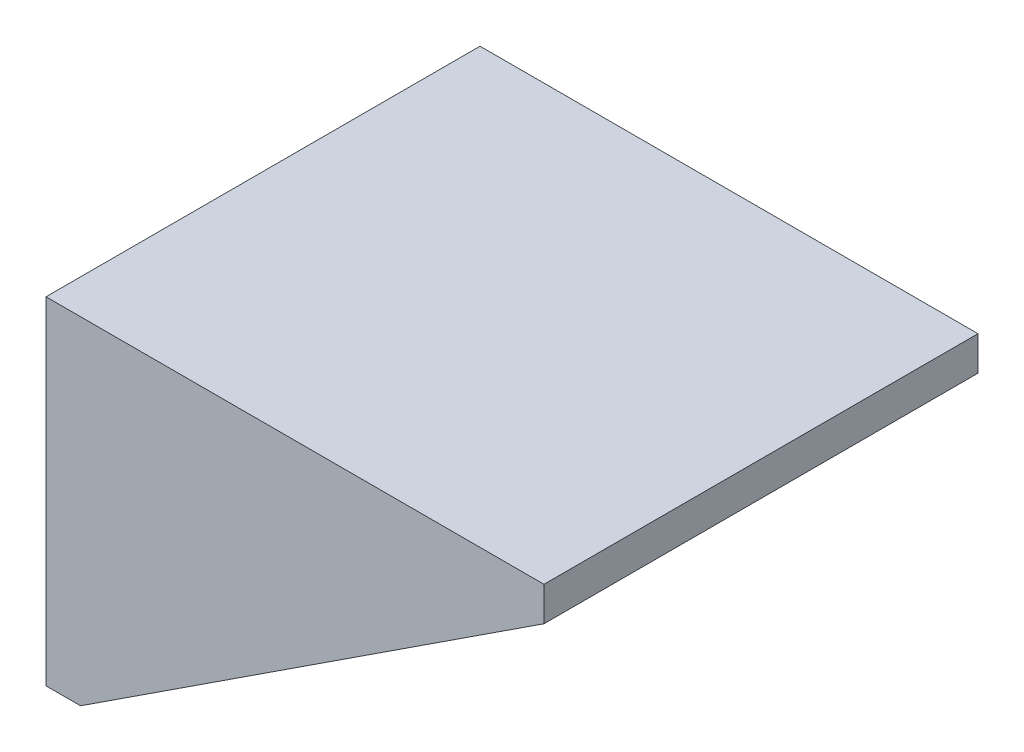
ISO-10303-21;
HEADER;
FILE_DESCRIPTION(('STEP AP214'),'2;1');
FILE_NAME('part.step','',(''),(''),'','','');
FILE_SCHEMA(('AUTOMOTIVE_DESIGN { 1 0 10303 214 1 1 1 1 }'));
ENDSEC;
DATA;
#1=APPLICATION_CONTEXT('core data for automotive mechanical design processes');
#2=APPLICATION_PROTOCOL_DEFINITION('international standard','automotive_design',2000,#1);
#3=PRODUCT_CONTEXT('',#1,'mechanical');
#4=PRODUCT('Part','Part','',(#3));
#5=PRODUCT_RELATED_PRODUCT_CATEGORY('part','',(#4));
#6=PRODUCT_DEFINITION_FORMATION('','',#4);
#7=PRODUCT_DEFINITION_CONTEXT('part definition',#1,'design');
#8=PRODUCT_DEFINITION('design','',#6,#7);
#9=PRODUCT_DEFINITION_SHAPE('','',#8);
#10=(LENGTH_UNIT() NAMED_UNIT(*) SI_UNIT(.MILLI.,.METRE.));
#11=(NAMED_UNIT(*) PLANE_ANGLE_UNIT() SI_UNIT($,.RADIAN.));
#12=(NAMED_UNIT(*) SI_UNIT($,.STERADIAN.) SOLID_ANGLE_UNIT());
#13=UNCERTAINTY_MEASURE_WITH_UNIT(LENGTH_MEASURE(1.E-05),#10,'distance_accuracy_value','');
#14=(GEOMETRIC_REPRESENTATION_CONTEXT(3) GLOBAL_UNCERTAINTY_ASSIGNED_CONTEXT((#13)) GLOBAL_UNIT_ASSIGNED_CONTEXT((#10,
#11,#12)) REPRESENTATION_CONTEXT('',''));
#15=CARTESIAN_POINT('',(0.,0.,0.));
#16=DIRECTION('',(0.,0.,1.));
#17=DIRECTION('',(1.,0.,0.));
#18=AXIS2_PLACEMENT_3D('',#15,#16,#17);
#19=CARTESIAN_POINT('',(0.,93.0742106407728,25.4));
#20=DIRECTION('',(1.,0.,0.));
#21=DIRECTION('',(0.,0.,-1.));
#22=AXIS2_PLACEMENT_3D('',#19,#20,#21);
#23=PLANE('',#22);
#24=DIRECTION('',(0.,-1.,0.));
#25=VECTOR('',#24,1.);
#26=CARTESIAN_POINT('',(0.,93.0742106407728,0.));
#27=LINE('',#26,#25);
#28=CARTESIAN_POINT('',(0.,112.794509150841,0.));
#29=VERTEX_POINT('',#28);
#30=CARTESIAN_POINT('',(0.,93.0742106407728,0.));
#31=VERTEX_POINT('',#30);
#32=EDGE_CURVE('E107',#29,#31,#27,.T.);
#33=ORIENTED_EDGE('',*,*,#32,.T.);
#34=DIRECTION('',(0.,0.,-1.));
#35=VECTOR('',#34,1.);
#36=CARTESIAN_POINT('',(0.,93.0742106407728,25.4));
#37=LINE('',#36,#35);
#38=CARTESIAN_POINT('',(0.,93.0742106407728,25.4));
#39=VERTEX_POINT('',#38);
#40=EDGE_CURVE('E11',#39,#31,#37,.T.);
#41=ORIENTED_EDGE('',*,*,#40,.F.);
#42=DIRECTION('',(0.,-1.,0.));
#43=VECTOR('',#42,1.);
#44=CARTESIAN_POINT('',(0.,93.0742106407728,25.4));
#45=LINE('',#44,#43);
#46=CARTESIAN_POINT('',(0.,112.794509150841,25.4));
#47=VERTEX_POINT('',#46);
#48=EDGE_CURVE('E115',#47,#39,#45,.T.);
#49=ORIENTED_EDGE('',*,*,#48,.F.);
#50=DIRECTION('',(0.,0.,-1.));
#51=VECTOR('',#50,1.);
#52=CARTESIAN_POINT('',(0.,112.794509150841,25.4));
#53=LINE('',#52,#51);
#54=EDGE_CURVE('E103',#47,#29,#53,.T.);
#55=ORIENTED_EDGE('',*,*,#54,.T.);
#56=EDGE_LOOP('',(#33,#41,#49,#55));
#57=FACE_BOUND('',#56,.T.);
#58=ADVANCED_FACE('F33',(#57),#23,.F.);
#59=CARTESIAN_POINT('',(0.,93.0742106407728,25.4));
#60=DIRECTION('',(0.,1.,0.));
#61=DIRECTION('',(0.,0.,1.));
#62=AXIS2_PLACEMENT_3D('',#59,#60,#61);
#63=PLANE('',#62);
#64=DIRECTION('',(1.,0.,0.));
#65=VECTOR('',#64,1.);
#66=CARTESIAN_POINT('',(0.,93.0742106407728,0.));
#67=LINE('',#66,#65);
#68=CARTESIAN_POINT('',(2.02050691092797,93.0742106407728,0.));
#69=VERTEX_POINT('',#68);
#70=EDGE_CURVE('E110',#31,#69,#67,.T.);
#71=ORIENTED_EDGE('',*,*,#70,.T.);
#72=DIRECTION('',(0.,0.,-1.));
#73=VECTOR('',#72,1.);
#74=CARTESIAN_POINT('',(2.02050691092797,93.0742106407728,25.4));
#75=LINE('',#74,#73);
#76=CARTESIAN_POINT('',(2.02050691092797,93.0742106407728,25.4));
#77=VERTEX_POINT('',#76);
#78=EDGE_CURVE('E41',#77,#69,#75,.T.);
#79=ORIENTED_EDGE('',*,*,#78,.F.);
#80=DIRECTION('',(1.,0.,0.));
#81=VECTOR('',#80,1.);
#82=CARTESIAN_POINT('',(0.,93.0742106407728,25.4));
#83=LINE('',#82,#81);
#84=EDGE_CURVE('E83',#39,#77,#83,.T.);
#85=ORIENTED_EDGE('',*,*,#84,.F.);
#86=ORIENTED_EDGE('',*,*,#40,.T.);
#87=EDGE_LOOP('',(#71,#79,#85,#86));
#88=FACE_BOUND('',#87,.T.);
#89=ADVANCED_FACE('F134',(#88),#63,.F.);
#90=CARTESIAN_POINT('',(29.1422918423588,110.792229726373,25.4));
#91=DIRECTION('',(-0.546915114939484,0.837188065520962,0.));
#92=DIRECTION('',(-0.837188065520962,-0.546915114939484,0.));
#93=AXIS2_PLACEMENT_3D('',#90,#91,#92);
#94=PLANE('',#93);
#95=DIRECTION('',(0.837188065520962,0.546915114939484,0.));
#96=VECTOR('',#95,1.);
#97=CARTESIAN_POINT('',(29.1422918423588,110.792229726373,0.));
#98=LINE('',#97,#96);
#99=CARTESIAN_POINT('',(29.1422918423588,110.792229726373,0.));
#100=VERTEX_POINT('',#99);
#101=EDGE_CURVE('E98',#69,#100,#98,.T.);
#102=ORIENTED_EDGE('',*,*,#101,.T.);
#103=DIRECTION('',(0.,0.,-1.));
#104=VECTOR('',#103,1.);
#105=CARTESIAN_POINT('',(29.1422918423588,110.792229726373,25.4));
#106=LINE('',#105,#104);
#107=CARTESIAN_POINT('',(29.1422918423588,110.792229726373,25.4));
#108=VERTEX_POINT('',#107);
#109=EDGE_CURVE('E95',#108,#100,#106,.T.);
#110=ORIENTED_EDGE('',*,*,#109,.F.);
#111=DIRECTION('',(0.837188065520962,0.546915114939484,0.));
#112=VECTOR('',#111,1.);
#113=CARTESIAN_POINT('',(29.1422918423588,110.792229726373,25.4));
#114=LINE('',#113,#112);
#115=EDGE_CURVE('E87',#77,#108,#114,.T.);
#116=ORIENTED_EDGE('',*,*,#115,.F.);
#117=ORIENTED_EDGE('',*,*,#78,.T.);
#118=EDGE_LOOP('',(#102,#110,#116,#117));
#119=FACE_BOUND('',#118,.T.);
#120=ADVANCED_FACE('F96',(#119),#94,.F.);
#121=CARTESIAN_POINT('',(29.1422918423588,110.792229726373,25.4));
#122=DIRECTION('',(-1.,0.,0.));
#123=DIRECTION('',(0.,0.,1.));
#124=AXIS2_PLACEMENT_3D('',#121,#122,#123);
#125=PLANE('',#124);
#126=DIRECTION('',(0.,1.,0.));
#127=VECTOR('',#126,1.);
#128=CARTESIAN_POINT('',(29.1422918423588,110.792229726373,0.));
#129=LINE('',#128,#127);
#130=CARTESIAN_POINT('',(29.1422918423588,112.794509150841,0.));
#131=VERTEX_POINT('',#130);
#132=EDGE_CURVE('E69',#100,#131,#129,.T.);
#133=ORIENTED_EDGE('',*,*,#132,.T.);
#134=DIRECTION('',(0.,0.,-1.));
#135=VECTOR('',#134,1.);
#136=CARTESIAN_POINT('',(29.1422918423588,112.794509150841,25.4));
#137=LINE('',#136,#135);
#138=CARTESIAN_POINT('',(29.1422918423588,112.794509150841,25.4));
#139=VERTEX_POINT('',#138);
#140=EDGE_CURVE('E99',#139,#131,#137,.T.);
#141=ORIENTED_EDGE('',*,*,#140,.F.);
#142=DIRECTION('',(0.,1.,0.));
#143=VECTOR('',#142,1.);
#144=CARTESIAN_POINT('',(29.1422918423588,110.792229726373,25.4));
#145=LINE('',#144,#143);
#146=EDGE_CURVE('E91',#108,#139,#145,.T.);
#147=ORIENTED_EDGE('',*,*,#146,.F.);
#148=ORIENTED_EDGE('',*,*,#109,.T.);
#149=EDGE_LOOP('',(#133,#141,#147,#148));
#150=FACE_BOUND('',#149,.T.);
#151=ADVANCED_FACE('F101',(#150),#125,.F.);
#152=CARTESIAN_POINT('',(0.,112.794509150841,25.4));
#153=DIRECTION('',(0.,-1.,0.));
#154=DIRECTION('',(0.,0.,-1.));
#155=AXIS2_PLACEMENT_3D('',#152,#153,#154);
#156=PLANE('',#155);
#157=DIRECTION('',(-1.,0.,0.));
#158=VECTOR('',#157,1.);
#159=CARTESIAN_POINT('',(0.,112.794509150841,0.));
#160=LINE('',#159,#158);
#161=EDGE_CURVE('E75',#131,#29,#160,.T.);
#162=ORIENTED_EDGE('',*,*,#161,.T.);
#163=ORIENTED_EDGE('',*,*,#54,.F.);
#164=DIRECTION('',(-1.,0.,0.));
#165=VECTOR('',#164,1.);
#166=CARTESIAN_POINT('',(0.,112.794509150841,25.4));
#167=LINE('',#166,#165);
#168=EDGE_CURVE('E49',#139,#47,#167,.T.);
#169=ORIENTED_EDGE('',*,*,#168,.F.);
#170=ORIENTED_EDGE('',*,*,#140,.T.);
#171=EDGE_LOOP('',(#162,#163,#169,#170));
#172=FACE_BOUND('',#171,.T.);
#173=ADVANCED_FACE('F123',(#172),#156,.F.);
#174=CARTESIAN_POINT('',(0.,0.,25.4));
#175=DIRECTION('',(0.,0.,-1.));
#176=DIRECTION('',(-1.,0.,0.));
#177=AXIS2_PLACEMENT_3D('',#174,#175,#176);
#178=PLANE('',#177);
#179=ORIENTED_EDGE('',*,*,#48,.T.);
#180=ORIENTED_EDGE('',*,*,#84,.T.);
#181=ORIENTED_EDGE('',*,*,#115,.T.);
#182=ORIENTED_EDGE('',*,*,#146,.T.);
#183=ORIENTED_EDGE('',*,*,#168,.T.);
#184=EDGE_LOOP('',(#179,#180,#181,#182,#183));
#185=FACE_BOUND('',#184,.T.);
#186=ADVANCED_FACE('F89',(#185),#178,.F.);
#187=CARTESIAN_POINT('',(0.,0.,0.));
#188=DIRECTION('',(0.,0.,-1.));
#189=DIRECTION('',(-1.,0.,0.));
#190=AXIS2_PLACEMENT_3D('',#187,#188,#189);
#191=PLANE('',#190);
#192=ORIENTED_EDGE('',*,*,#32,.F.);
#193=ORIENTED_EDGE('',*,*,#161,.F.);
#194=ORIENTED_EDGE('',*,*,#132,.F.);
#195=ORIENTED_EDGE('',*,*,#101,.F.);
#196=ORIENTED_EDGE('',*,*,#70,.F.);
#197=EDGE_LOOP('',(#192,#193,#194,#195,#196));
#198=FACE_BOUND('',#197,.T.);
#199=ADVANCED_FACE('F119',(#198),#191,.T.);
#200=CLOSED_SHELL('',(#58,#89,#120,#151,#173,#186,#199));
#201=MANIFOLD_SOLID_BREP('B2',#200);
#202=ADVANCED_BREP_SHAPE_REPRESENTATION('',(#18,#201),#14);
#203=SHAPE_DEFINITION_REPRESENTATION(#9,#202);
ENDSEC;
END-ISO-10303-21;
